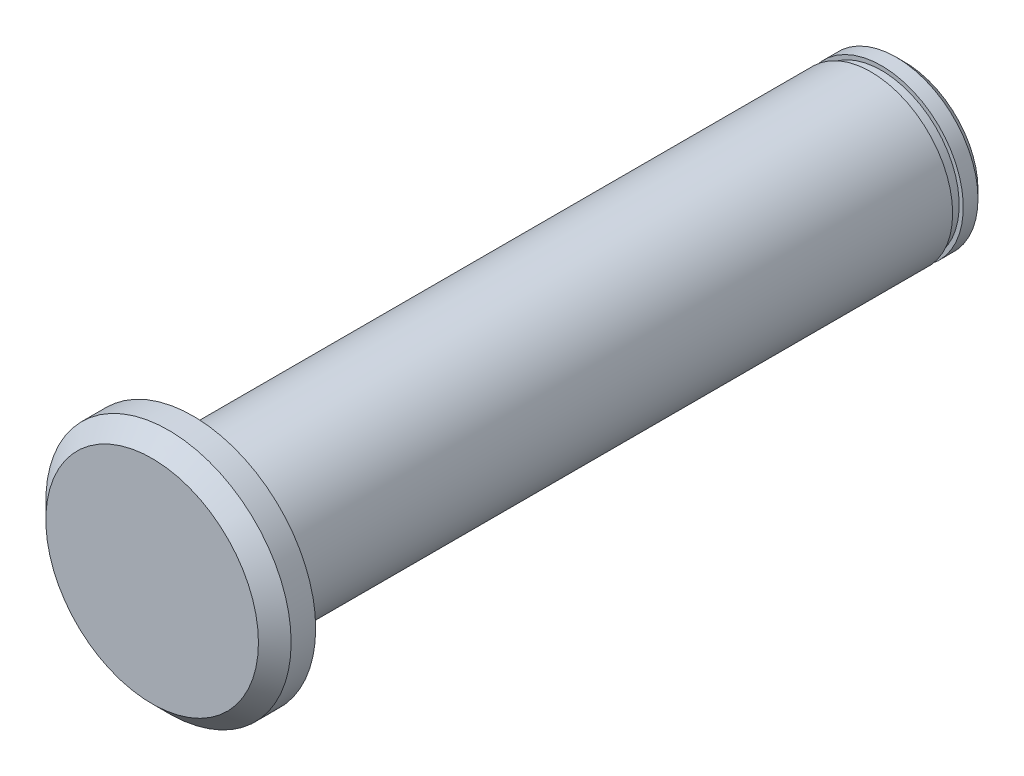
from build123d import *

# Parameters (mm, degrees)
ESQUISSE1_R      = 10
EXTRUSION1_DEPTH = 87
ESQUISSE2_R      = 15
EXTRUSION2_DEPTH = 5
CHANFREIN1_SIZE  = 2
ESQUISSE3_W      = 1.3
ESQUISSE3_H      = 4.310698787
CHANFREIN2_SIZE  = 1


with BuildPart() as part:
    # Esquisse1 → Extrusion1 (new body)
    with BuildSketch(Plane.XY):
        Circle(ESQUISSE1_R)
    extrude(amount=EXTRUSION1_DEPTH)

    # Esquisse2 → Extrusion2 (add)
    with BuildSketch(Plane.XY.offset(87)):
        Circle(ESQUISSE2_R)
    extrude(amount=EXTRUSION2_DEPTH)

    # Chanfrein1
    chanfrein1_edges = [part.edges().sort_by_distance(p)[0] for p in [
        (-15, 0, 92),
    ]]
    chamfer(chanfrein1_edges, length=CHANFREIN1_SIZE)

    # Esquisse3 → Enl_vement de mati_re-R_volution1 (revolve, cut)
    with BuildSketch(Plane(origin=(0, 0, 0), x_dir=(0, 0, -1), z_dir=(1, 0, 0)), mode=Mode.PRIVATE) as enl_vement_de_mati_re_r_volution1_sk:
        with Locations((-3.45, 11.655349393)):
            Rectangle(ESQUISSE3_W, ESQUISSE3_H)
    revolve(enl_vement_de_mati_re_r_volution1_sk.sketch.rotate(Axis((0, 0, 0), (0, 0, 1)), 90), axis=Axis((0, 0, 0), (0, 0, 1)), mode=Mode.SUBTRACT)

    # Chanfrein2
    chanfrein2_edges = [part.edges().sort_by_distance(p)[0] for p in [
        (-10, 0, 0),
    ]]
    chamfer(chanfrein2_edges, length=CHANFREIN2_SIZE)


solid = part.part
